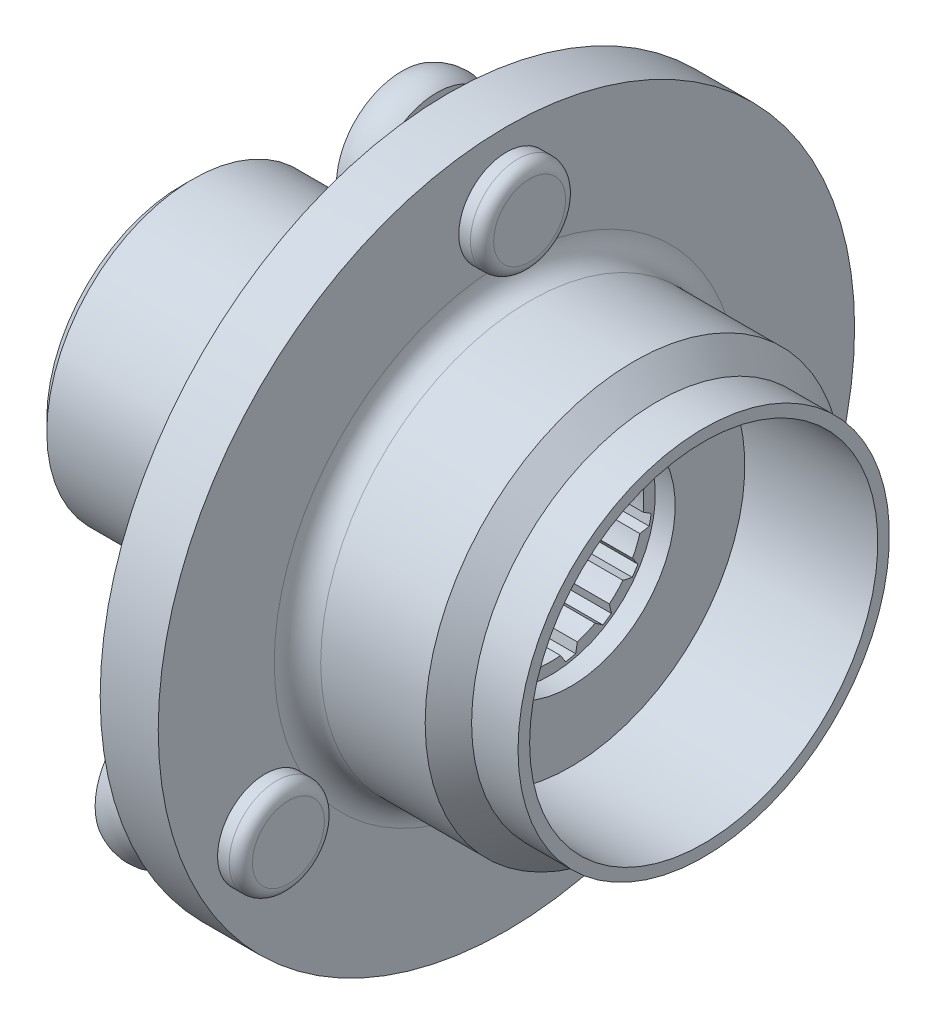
from build123d import *

# Parameters (mm, degrees)
R_P_TITION_CIRCULAIRE1_COUNT = 3
ENL_V_MAT_EXTRU_1_DEPTH      = 28.852674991
R_P_TITION_CIRCULAIRE2_COUNT = 16


with BuildPart() as part:
    # Esquisse1 → Base-R_volution (revolve)
    with BuildSketch(Plane.XY, mode=Mode.PRIVATE) as base_r_volution_sk:
        with BuildLine():
            Line((0, 6.5), (0, 15))
            Line((0, 15), (2.5, 15))
            Line((2.5, 15), (2.5, 10))
            ThreePointArc((2.5, 10), (2.792893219, 9.292893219), (3.5, 9))
            Line((3.5, 9), (8, 9))
            Line((8, 9), (9, 8))
            Line((9, 8), (11, 8))
            Line((11, 8), (11, 7.5))
            Line((11, 7.5), (5.270857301, 7.5))
            Line((5.270857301, 7.5), (5.270857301, 4.5))
            Line((5.270857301, 4.5), (4.414683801, 4.5))
            Line((4.414683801, 4.5), (4.414683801, 4))
            Line((4.414683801, 4), (-7.048528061, 4))
            Line((-7.048528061, 4), (-7.048528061, 4.5))
            Line((-7.048528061, 4.5), (-11.015640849, 4.5))
            Line((-11.015640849, 4.5), (-11.5, 4.984359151))
            Line((-11.5, 4.984359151), (-11.5, 5.8))
            Line((-11.5, 5.8), (-11, 6.3))
            Line((-11, 6.3), (-4, 6.3))
            Line((-4, 6.3), (-4, 6.5))
            Line((-4, 6.5), (0, 6.5))
        make_face()
    revolve(base_r_volution_sk.sketch.rotate(Axis((0, 0, 0), (1, 0, 0)), 90), axis=Axis((0, 0, 0), (1, 0, 0)))

    # Esquisse2 → Boss.-R_vol.1 (revolve)
    with BuildSketch(Plane.XY, mode=Mode.PRIVATE) as boss_r_vol_1_sk:
        with BuildLine():
            Line((-2, 14.825926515), (-2, 12))
            Line((-2, 12), (3.5, 12))
            Line((3.5, 12), (3.5, 13.549844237))
            ThreePointArc((3.5, 13.549844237), (3.353553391, 13.903397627), (3, 14.049844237))
            Line((3, 14.049844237), (2.5, 14.049844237))
            Line((2.5, 14.049844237), (2.5, 13.5))
            Line((2.5, 13.5), (-0.5, 13.5))
            Line((-0.5, 13.5), (-0.5, 14.77158125))
            ThreePointArc((-0.5, 14.77158125), (-1.242717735, 14.999753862), (-2, 14.825926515))
        make_face()
    boss_r_vol_1 = revolve(boss_r_vol_1_sk.sketch.rotate(Axis((-4, 12, 0), (1, 0, 0)), 90), axis=Axis((-4, 12, 0), (1, 0, 0)))

    # R_p_tition circulaire1: Boss.-R_vol.1 ×3 about axis
    r_p_tition_circulaire1_axis = Axis((0, 0, 0), (1, 0, 0))
    for i in range(1, R_P_TITION_CIRCULAIRE1_COUNT):
        add(boss_r_vol_1.rotate(r_p_tition_circulaire1_axis, i * 360 / R_P_TITION_CIRCULAIRE1_COUNT))

    # Esquisse3 → Enl_v. mat.-Extru.1 (cut, through all)
    with BuildSketch(Plane.ZY.offset(7.048528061)):
        Polygon((-0.28620955, 3.776566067), (-0.634766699, 4.324785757), (-1.068575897, 4.238495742), (-1.18080612, 3.598619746), align=None)
    enl_v_mat_extru_1 = extrude(amount=-ENL_V_MAT_EXTRU_1_DEPTH, mode=Mode.SUBTRACT)

    # R_p_tition circulaire2: Enl_v. mat.-Extru.1 ×16 about axis
    r_p_tition_circulaire2_axis = Axis((0, 0, 0), (1, 0, 0))
    for i in range(1, R_P_TITION_CIRCULAIRE2_COUNT):
        add(enl_v_mat_extru_1.rotate(r_p_tition_circulaire2_axis, i * 360 / R_P_TITION_CIRCULAIRE2_COUNT), mode=Mode.SUBTRACT)


solid = part.part
